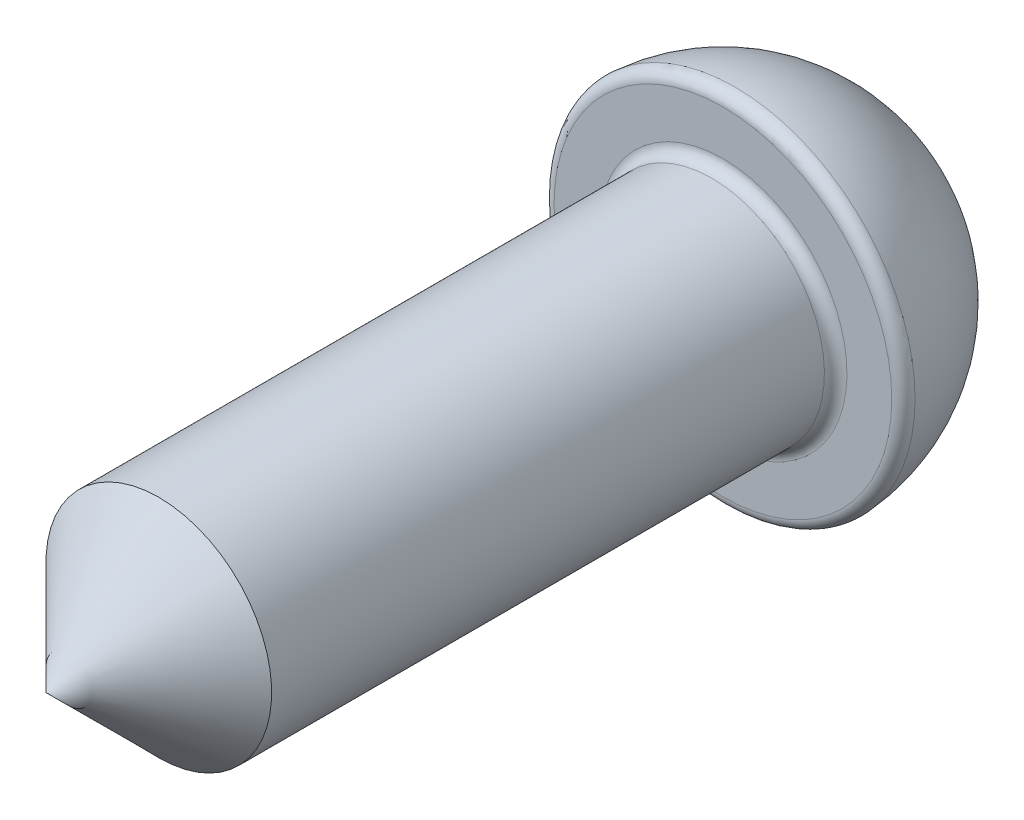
ISO-10303-21;
HEADER;
FILE_DESCRIPTION(('STEP AP214'),'2;1');
FILE_NAME('part.step','',(''),(''),'','','');
FILE_SCHEMA(('AUTOMOTIVE_DESIGN { 1 0 10303 214 1 1 1 1 }'));
ENDSEC;
DATA;
#1=APPLICATION_CONTEXT('core data for automotive mechanical design processes');
#2=APPLICATION_PROTOCOL_DEFINITION('international standard','automotive_design',2000,#1);
#3=PRODUCT_CONTEXT('',#1,'mechanical');
#4=PRODUCT('Part','Part','',(#3));
#5=PRODUCT_RELATED_PRODUCT_CATEGORY('part','',(#4));
#6=PRODUCT_DEFINITION_FORMATION('','',#4);
#7=PRODUCT_DEFINITION_CONTEXT('part definition',#1,'design');
#8=PRODUCT_DEFINITION('design','',#6,#7);
#9=PRODUCT_DEFINITION_SHAPE('','',#8);
#10=(LENGTH_UNIT() NAMED_UNIT(*) SI_UNIT(.MILLI.,.METRE.));
#11=(NAMED_UNIT(*) PLANE_ANGLE_UNIT() SI_UNIT($,.RADIAN.));
#12=(NAMED_UNIT(*) SI_UNIT($,.STERADIAN.) SOLID_ANGLE_UNIT());
#13=UNCERTAINTY_MEASURE_WITH_UNIT(LENGTH_MEASURE(1.E-05),#10,'distance_accuracy_value','');
#14=(GEOMETRIC_REPRESENTATION_CONTEXT(3) GLOBAL_UNCERTAINTY_ASSIGNED_CONTEXT((#13)) GLOBAL_UNIT_ASSIGNED_CONTEXT((#10,
#11,#12)) REPRESENTATION_CONTEXT('',''));
#15=CARTESIAN_POINT('',(0.,0.,0.));
#16=DIRECTION('',(0.,0.,1.));
#17=DIRECTION('',(1.,0.,0.));
#18=AXIS2_PLACEMENT_3D('',#15,#16,#17);
#19=CARTESIAN_POINT('',(0.,0.,7.00000000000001));
#20=DIRECTION('',(0.,0.,-1.));
#21=DIRECTION('',(0.,1.,0.));
#22=AXIS2_PLACEMENT_3D('',#19,#20,#21);
#23=CONICAL_SURFACE('',#22,2.5,0.78539816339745);
#24=CARTESIAN_POINT('',(0.,0.,9.5));
#25=VERTEX_POINT('',#24);
#26=VERTEX_LOOP('',#25);
#27=FACE_BOUND('',#26,.T.);
#28=CARTESIAN_POINT('',(0.,0.,7.00000000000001));
#29=DIRECTION('',(0.,0.,1.));
#30=DIRECTION('',(0.,-1.,0.));
#31=AXIS2_PLACEMENT_3D('',#28,#29,#30);
#32=CIRCLE('',#31,2.5);
#33=CARTESIAN_POINT('',(0.,-2.5,7.00000000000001));
#34=VERTEX_POINT('',#33);
#35=EDGE_CURVE('E47',#34,#34,#32,.T.);
#36=ORIENTED_EDGE('',*,*,#35,.T.);
#37=EDGE_LOOP('',(#36));
#38=FACE_BOUND('',#37,.T.);
#39=ADVANCED_FACE('F31',(#27,#38),#23,.T.);
#40=CARTESIAN_POINT('',(0.,0.,-5.5));
#41=DIRECTION('',(0.,0.,1.));
#42=DIRECTION('',(0.,-1.,0.));
#43=AXIS2_PLACEMENT_3D('',#40,#41,#42);
#44=SPHERICAL_SURFACE('',#43,4.);
#45=CARTESIAN_POINT('',(0.,0.,-5.76666666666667));
#46=DIRECTION('',(0.,0.,1.));
#47=DIRECTION('',(0.,-1.,0.));
#48=AXIS2_PLACEMENT_3D('',#45,#46,#47);
#49=CIRCLE('',#48,3.99110121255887);
#50=CARTESIAN_POINT('',(0.,-3.99110121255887,-5.76666666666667));
#51=VERTEX_POINT('',#50);
#52=EDGE_CURVE('E38',#51,#51,#49,.F.);
#53=ORIENTED_EDGE('',*,*,#52,.T.);
#54=EDGE_LOOP('',(#53));
#55=FACE_BOUND('',#54,.T.);
#56=ADVANCED_FACE('F43',(#55),#44,.T.);
#57=CARTESIAN_POINT('',(0.,2.5,-5.5));
#58=DIRECTION('',(0.,0.,-1.));
#59=DIRECTION('',(0.,1.,0.));
#60=AXIS2_PLACEMENT_3D('',#57,#58,#59);
#61=PLANE('',#60);
#62=CARTESIAN_POINT('',(0.,0.,-5.5));
#63=DIRECTION('',(0.,0.,-1.));
#64=DIRECTION('',(0.,1.,0.));
#65=AXIS2_PLACEMENT_3D('',#62,#63,#64);
#66=CIRCLE('',#65,3.74165738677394);
#67=CARTESIAN_POINT('',(0.,3.74165738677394,-5.5));
#68=VERTEX_POINT('',#67);
#69=EDGE_CURVE('E52',#68,#68,#66,.F.);
#70=ORIENTED_EDGE('',*,*,#69,.T.);
#71=EDGE_LOOP('',(#70));
#72=FACE_BOUND('',#71,.T.);
#73=CARTESIAN_POINT('',(0.,0.,-5.5));
#74=DIRECTION('',(0.,0.,-1.));
#75=DIRECTION('',(0.,1.,0.));
#76=AXIS2_PLACEMENT_3D('',#73,#74,#75);
#77=CIRCLE('',#76,2.75);
#78=CARTESIAN_POINT('',(0.,2.75,-5.5));
#79=VERTEX_POINT('',#78);
#80=EDGE_CURVE('E49',#79,#79,#77,.T.);
#81=ORIENTED_EDGE('',*,*,#80,.T.);
#82=EDGE_LOOP('',(#81));
#83=FACE_BOUND('',#82,.T.);
#84=ADVANCED_FACE('F66',(#72,#83),#61,.F.);
#85=CARTESIAN_POINT('',(0.,0.,9.5));
#86=DIRECTION('',(0.,0.,1.));
#87=DIRECTION('',(0.,-1.,0.));
#88=AXIS2_PLACEMENT_3D('',#85,#86,#87);
#89=CYLINDRICAL_SURFACE('',#88,2.5);
#90=CARTESIAN_POINT('',(0.,0.,-5.25));
#91=DIRECTION('',(0.,0.,-1.));
#92=DIRECTION('',(0.,1.,0.));
#93=AXIS2_PLACEMENT_3D('',#90,#91,#92);
#94=CIRCLE('',#93,2.5);
#95=CARTESIAN_POINT('',(0.,2.5,-5.25));
#96=VERTEX_POINT('',#95);
#97=EDGE_CURVE('E11',#96,#96,#94,.F.);
#98=ORIENTED_EDGE('',*,*,#97,.T.);
#99=EDGE_LOOP('',(#98));
#100=FACE_BOUND('',#99,.T.);
#101=ORIENTED_EDGE('',*,*,#35,.F.);
#102=EDGE_LOOP('',(#101));
#103=FACE_BOUND('',#102,.T.);
#104=ADVANCED_FACE('F63',(#100,#103),#89,.T.);
#105=CARTESIAN_POINT('',(0.,0.,-5.75));
#106=DIRECTION('',(0.,0.,-1.));
#107=DIRECTION('',(0.,1.,0.));
#108=AXIS2_PLACEMENT_3D('',#105,#106,#107);
#109=TOROIDAL_SURFACE('',#108,3.74165738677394,0.25);
#110=ORIENTED_EDGE('',*,*,#52,.F.);
#111=EDGE_LOOP('',(#110));
#112=FACE_BOUND('',#111,.T.);
#113=ORIENTED_EDGE('',*,*,#69,.F.);
#114=EDGE_LOOP('',(#113));
#115=FACE_BOUND('',#114,.T.);
#116=ADVANCED_FACE('F60',(#112,#115),#109,.T.);
#117=CARTESIAN_POINT('',(0.,0.,-5.25));
#118=DIRECTION('',(0.,0.,-1.));
#119=DIRECTION('',(0.,1.,0.));
#120=AXIS2_PLACEMENT_3D('',#117,#118,#119);
#121=TOROIDAL_SURFACE('',#120,2.75,0.25);
#122=ORIENTED_EDGE('',*,*,#80,.F.);
#123=EDGE_LOOP('',(#122));
#124=FACE_BOUND('',#123,.T.);
#125=ORIENTED_EDGE('',*,*,#97,.F.);
#126=EDGE_LOOP('',(#125));
#127=FACE_BOUND('',#126,.T.);
#128=ADVANCED_FACE('F33',(#124,#127),#121,.F.);
#129=CLOSED_SHELL('',(#39,#56,#84,#104,#116,#128));
#130=MANIFOLD_SOLID_BREP('B2',#129);
#131=ADVANCED_BREP_SHAPE_REPRESENTATION('',(#18,#130),#14);
#132=SHAPE_DEFINITION_REPRESENTATION(#9,#131);
ENDSEC;
END-ISO-10303-21;
